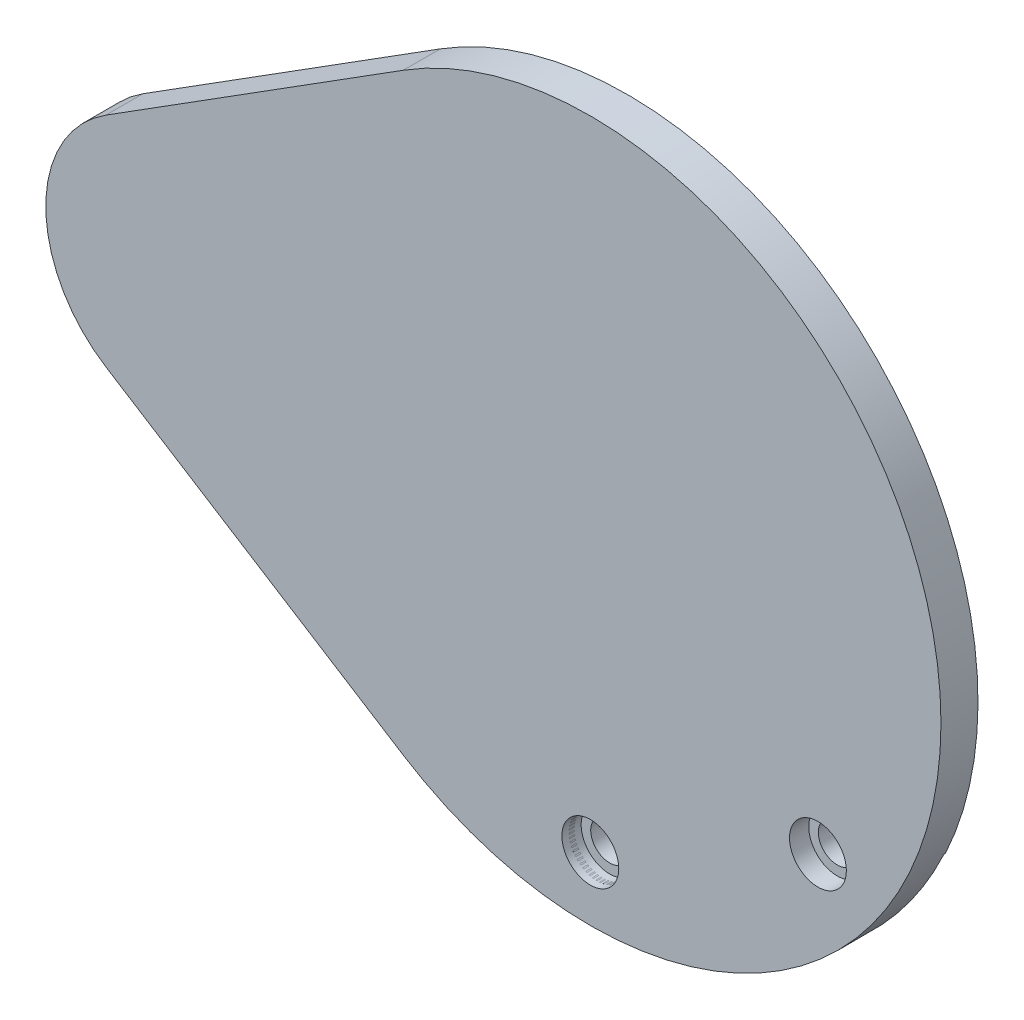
ISO-10303-21;
HEADER;
FILE_DESCRIPTION(('STEP AP214'),'2;1');
FILE_NAME('part.step','',(''),(''),'','','');
FILE_SCHEMA(('AUTOMOTIVE_DESIGN { 1 0 10303 214 1 1 1 1 }'));
ENDSEC;
DATA;
#1=APPLICATION_CONTEXT('core data for automotive mechanical design processes');
#2=APPLICATION_PROTOCOL_DEFINITION('international standard','automotive_design',2000,#1);
#3=PRODUCT_CONTEXT('',#1,'mechanical');
#4=PRODUCT('Part','Part','',(#3));
#5=PRODUCT_RELATED_PRODUCT_CATEGORY('part','',(#4));
#6=PRODUCT_DEFINITION_FORMATION('','',#4);
#7=PRODUCT_DEFINITION_CONTEXT('part definition',#1,'design');
#8=PRODUCT_DEFINITION('design','',#6,#7);
#9=PRODUCT_DEFINITION_SHAPE('','',#8);
#10=(LENGTH_UNIT() NAMED_UNIT(*) SI_UNIT(.MILLI.,.METRE.));
#11=(NAMED_UNIT(*) PLANE_ANGLE_UNIT() SI_UNIT($,.RADIAN.));
#12=(NAMED_UNIT(*) SI_UNIT($,.STERADIAN.) SOLID_ANGLE_UNIT());
#13=UNCERTAINTY_MEASURE_WITH_UNIT(LENGTH_MEASURE(1.E-05),#10,'distance_accuracy_value','');
#14=(GEOMETRIC_REPRESENTATION_CONTEXT(3) GLOBAL_UNCERTAINTY_ASSIGNED_CONTEXT((#13)) GLOBAL_UNIT_ASSIGNED_CONTEXT((#10,
#11,#12)) REPRESENTATION_CONTEXT('',''));
#15=CARTESIAN_POINT('',(0.,0.,0.));
#16=DIRECTION('',(0.,0.,1.));
#17=DIRECTION('',(1.,0.,0.));
#18=AXIS2_PLACEMENT_3D('',#15,#16,#17);
#19=CARTESIAN_POINT('',(153.008626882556,-117.697925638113,0.));
#20=DIRECTION('',(0.,0.,1.));
#21=DIRECTION('',(1.,0.,0.));
#22=AXIS2_PLACEMENT_3D('',#19,#20,#21);
#23=CYLINDRICAL_SURFACE('',#22,12.7);
#24=CARTESIAN_POINT('',(153.008626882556,-117.697925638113,11.938));
#25=DIRECTION('',(0.,0.,1.));
#26=DIRECTION('',(1.,0.,0.));
#27=AXIS2_PLACEMENT_3D('',#24,#25,#26);
#28=CIRCLE('',#27,12.7);
#29=CARTESIAN_POINT('',(165.708626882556,-117.697925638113,11.938));
#30=VERTEX_POINT('',#29);
#31=EDGE_CURVE('E163',#30,#30,#28,.T.);
#32=ORIENTED_EDGE('',*,*,#31,.T.);
#33=EDGE_LOOP('',(#32));
#34=FACE_BOUND('',#33,.T.);
#35=CARTESIAN_POINT('',(153.008626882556,-117.697925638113,1.016));
#36=DIRECTION('',(0.,0.,-1.));
#37=DIRECTION('',(-1.,0.,0.));
#38=AXIS2_PLACEMENT_3D('',#35,#36,#37);
#39=CIRCLE('',#38,12.7);
#40=CARTESIAN_POINT('',(140.308626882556,-117.697925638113,1.016));
#41=VERTEX_POINT('',#40);
#42=EDGE_CURVE('E46',#41,#41,#39,.F.);
#43=ORIENTED_EDGE('',*,*,#42,.F.);
#44=EDGE_LOOP('',(#43));
#45=FACE_BOUND('',#44,.T.);
#46=ADVANCED_FACE('F42',(#34,#45),#23,.F.);
#47=CARTESIAN_POINT('',(0.,-193.04,0.));
#48=DIRECTION('',(0.,0.,1.));
#49=DIRECTION('',(1.,0.,0.));
#50=AXIS2_PLACEMENT_3D('',#47,#48,#49);
#51=CYLINDRICAL_SURFACE('',#50,12.7);
#52=CARTESIAN_POINT('',(0.,-193.04,11.938));
#53=DIRECTION('',(0.,0.,1.));
#54=DIRECTION('',(1.,0.,0.));
#55=AXIS2_PLACEMENT_3D('',#52,#53,#54);
#56=CIRCLE('',#55,12.7);
#57=CARTESIAN_POINT('',(12.7,-193.04,11.938));
#58=VERTEX_POINT('',#57);
#59=EDGE_CURVE('E159',#58,#58,#56,.T.);
#60=ORIENTED_EDGE('',*,*,#59,.T.);
#61=EDGE_LOOP('',(#60));
#62=FACE_BOUND('',#61,.T.);
#63=CARTESIAN_POINT('',(0.,-193.04,1.016));
#64=DIRECTION('',(0.,0.,-1.));
#65=DIRECTION('',(-1.,0.,0.));
#66=AXIS2_PLACEMENT_3D('',#63,#64,#65);
#67=CIRCLE('',#66,12.7);
#68=CARTESIAN_POINT('',(-12.7,-193.04,1.016));
#69=VERTEX_POINT('',#68);
#70=EDGE_CURVE('E165',#69,#69,#67,.F.);
#71=ORIENTED_EDGE('',*,*,#70,.F.);
#72=EDGE_LOOP('',(#71));
#73=FACE_BOUND('',#72,.T.);
#74=ADVANCED_FACE('F222',(#62,#73),#51,.F.);
#75=CARTESIAN_POINT('',(-279.4,0.,24.892));
#76=DIRECTION('',(0.,0.,-1.));
#77=DIRECTION('',(-1.,0.,0.));
#78=AXIS2_PLACEMENT_3D('',#75,#76,#77);
#79=CYLINDRICAL_SURFACE('',#78,86.6983406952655);
#80=DIRECTION('',(0.,0.,-1.));
#81=VECTOR('',#80,1.);
#82=CARTESIAN_POINT('',(-325.647097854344,-73.3335408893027,24.892));
#83=LINE('',#82,#81);
#84=CARTESIAN_POINT('',(-325.647097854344,-73.3335408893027,24.892));
#85=VERTEX_POINT('',#84);
#86=CARTESIAN_POINT('',(-325.647097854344,-73.3335408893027,0.));
#87=VERTEX_POINT('',#86);
#88=EDGE_CURVE('E13',#85,#87,#83,.T.);
#89=ORIENTED_EDGE('',*,*,#88,.F.);
#90=CARTESIAN_POINT('',(-279.4,0.,24.892));
#91=DIRECTION('',(0.,0.,1.));
#92=DIRECTION('',(1.,0.,0.));
#93=AXIS2_PLACEMENT_3D('',#90,#91,#92);
#94=CIRCLE('',#93,86.6983406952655);
#95=CARTESIAN_POINT('',(-325.647097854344,73.3335408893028,24.892));
#96=VERTEX_POINT('',#95);
#97=EDGE_CURVE('E141',#96,#85,#94,.T.);
#98=ORIENTED_EDGE('',*,*,#97,.F.);
#99=DIRECTION('',(0.,0.,-1.));
#100=VECTOR('',#99,1.);
#101=CARTESIAN_POINT('',(-325.647097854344,73.3335408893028,24.892));
#102=LINE('',#101,#100);
#103=CARTESIAN_POINT('',(-325.647097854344,73.3335408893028,0.));
#104=VERTEX_POINT('',#103);
#105=EDGE_CURVE('E154',#96,#104,#102,.T.);
#106=ORIENTED_EDGE('',*,*,#105,.T.);
#107=CARTESIAN_POINT('',(-279.4,0.,0.));
#108=DIRECTION('',(0.,0.,1.));
#109=DIRECTION('',(1.,0.,0.));
#110=AXIS2_PLACEMENT_3D('',#107,#108,#109);
#111=CIRCLE('',#110,86.6983406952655);
#112=EDGE_CURVE('E136',#104,#87,#111,.T.);
#113=ORIENTED_EDGE('',*,*,#112,.T.);
#114=EDGE_LOOP('',(#89,#98,#106,#113));
#115=FACE_BOUND('',#114,.T.);
#116=ADVANCED_FACE('F198',(#115),#79,.T.);
#117=CARTESIAN_POINT('',(-325.647097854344,-73.3335408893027,24.892));
#118=DIRECTION('',(0.533425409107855,0.845847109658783,0.));
#119=DIRECTION('',(-0.845847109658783,0.533425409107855,0.));
#120=AXIS2_PLACEMENT_3D('',#117,#118,#119);
#121=PLANE('',#120);
#122=DIRECTION('',(0.,0.,-1.));
#123=VECTOR('',#122,1.);
#124=CARTESIAN_POINT('',(-125.748319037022,-199.397798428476,24.892));
#125=LINE('',#124,#123);
#126=CARTESIAN_POINT('',(-125.748319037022,-199.397798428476,24.892));
#127=VERTEX_POINT('',#126);
#128=CARTESIAN_POINT('',(-125.748319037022,-199.397798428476,0.));
#129=VERTEX_POINT('',#128);
#130=EDGE_CURVE('E51',#127,#129,#125,.T.);
#131=ORIENTED_EDGE('',*,*,#130,.F.);
#132=DIRECTION('',(0.845847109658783,-0.533425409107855,0.));
#133=VECTOR('',#132,1.);
#134=CARTESIAN_POINT('',(-325.647097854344,-73.3335408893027,24.892));
#135=LINE('',#134,#133);
#136=EDGE_CURVE('E143',#85,#127,#135,.T.);
#137=ORIENTED_EDGE('',*,*,#136,.F.);
#138=ORIENTED_EDGE('',*,*,#88,.T.);
#139=DIRECTION('',(0.845847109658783,-0.533425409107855,0.));
#140=VECTOR('',#139,1.);
#141=CARTESIAN_POINT('',(-325.647097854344,-73.3335408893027,0.));
#142=LINE('',#141,#140);
#143=EDGE_CURVE('E132',#87,#129,#142,.T.);
#144=ORIENTED_EDGE('',*,*,#143,.T.);
#145=EDGE_LOOP('',(#131,#137,#138,#144));
#146=FACE_BOUND('',#145,.T.);
#147=ADVANCED_FACE('F44',(#146),#121,.F.);
#148=CARTESIAN_POINT('',(0.,0.,24.892));
#149=DIRECTION('',(0.,0.,-1.));
#150=DIRECTION('',(-1.,0.,0.));
#151=AXIS2_PLACEMENT_3D('',#148,#149,#150);
#152=CYLINDRICAL_SURFACE('',#151,235.7374);
#153=CARTESIAN_POINT('',(0.,0.,0.));
#154=DIRECTION('',(0.,0.,1.));
#155=DIRECTION('',(1.,0.,0.));
#156=AXIS2_PLACEMENT_3D('',#153,#154,#155);
#157=CIRCLE('',#156,235.7374);
#158=CARTESIAN_POINT('',(51.6243738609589,-230.015316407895,0.));
#159=VERTEX_POINT('',#158);
#160=CARTESIAN_POINT('',(150.840478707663,-181.160900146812,0.));
#161=VERTEX_POINT('',#160);
#162=EDGE_CURVE('E131',#159,#161,#157,.T.);
#163=ORIENTED_EDGE('',*,*,#162,.T.);
#164=DIRECTION('',(0.,0.,-1.));
#165=VECTOR('',#164,1.);
#166=CARTESIAN_POINT('',(150.840478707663,-181.160900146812,0.508000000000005));
#167=LINE('',#166,#165);
#168=CARTESIAN_POINT('',(150.840478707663,-181.160900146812,1.016));
#169=VERTEX_POINT('',#168);
#170=EDGE_CURVE('E59',#161,#169,#167,.F.);
#171=ORIENTED_EDGE('',*,*,#170,.T.);
#172=CARTESIAN_POINT('',(0.,0.,1.016));
#173=DIRECTION('',(0.,0.,-1.));
#174=DIRECTION('',(-1.,0.,0.));
#175=AXIS2_PLACEMENT_3D('',#172,#173,#174);
#176=CIRCLE('',#175,235.7374);
#177=CARTESIAN_POINT('',(213.792009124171,-99.3232026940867,1.016));
#178=VERTEX_POINT('',#177);
#179=EDGE_CURVE('E124',#178,#169,#176,.T.);
#180=ORIENTED_EDGE('',*,*,#179,.F.);
#181=DIRECTION('',(0.,0.,-1.));
#182=VECTOR('',#181,1.);
#183=CARTESIAN_POINT('',(213.792009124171,-99.3232026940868,0.508000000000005));
#184=LINE('',#183,#182);
#185=CARTESIAN_POINT('',(213.792009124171,-99.3232026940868,0.));
#186=VERTEX_POINT('',#185);
#187=EDGE_CURVE('E110',#178,#186,#184,.T.);
#188=ORIENTED_EDGE('',*,*,#187,.T.);
#189=CARTESIAN_POINT('',(-125.748319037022,199.397798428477,0.));
#190=VERTEX_POINT('',#189);
#191=EDGE_CURVE('E122',#186,#190,#157,.T.);
#192=ORIENTED_EDGE('',*,*,#191,.T.);
#193=DIRECTION('',(0.,0.,-1.));
#194=VECTOR('',#193,1.);
#195=CARTESIAN_POINT('',(-125.748319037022,199.397798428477,24.892));
#196=LINE('',#195,#194);
#197=CARTESIAN_POINT('',(-125.748319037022,199.397798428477,24.892));
#198=VERTEX_POINT('',#197);
#199=EDGE_CURVE('E156',#198,#190,#196,.T.);
#200=ORIENTED_EDGE('',*,*,#199,.F.);
#201=CARTESIAN_POINT('',(0.,0.,24.892));
#202=DIRECTION('',(0.,0.,1.));
#203=DIRECTION('',(1.,0.,0.));
#204=AXIS2_PLACEMENT_3D('',#201,#202,#203);
#205=CIRCLE('',#204,235.7374);
#206=EDGE_CURVE('E148',#127,#198,#205,.T.);
#207=ORIENTED_EDGE('',*,*,#206,.F.);
#208=ORIENTED_EDGE('',*,*,#130,.T.);
#209=CARTESIAN_POINT('',(-51.6243738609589,-230.015316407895,0.));
#210=VERTEX_POINT('',#209);
#211=EDGE_CURVE('E134',#129,#210,#157,.T.);
#212=ORIENTED_EDGE('',*,*,#211,.T.);
#213=DIRECTION('',(0.,0.,-1.));
#214=VECTOR('',#213,1.);
#215=CARTESIAN_POINT('',(-51.6243738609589,-230.015316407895,0.508000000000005));
#216=LINE('',#215,#214);
#217=CARTESIAN_POINT('',(-51.624373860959,-230.015316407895,1.016));
#218=VERTEX_POINT('',#217);
#219=EDGE_CURVE('E67',#210,#218,#216,.F.);
#220=ORIENTED_EDGE('',*,*,#219,.T.);
#221=CARTESIAN_POINT('',(0.,0.,1.016));
#222=DIRECTION('',(0.,0.,-1.));
#223=DIRECTION('',(-1.,0.,0.));
#224=AXIS2_PLACEMENT_3D('',#221,#222,#223);
#225=CIRCLE('',#224,235.7374);
#226=CARTESIAN_POINT('',(51.624373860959,-230.015316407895,1.016));
#227=VERTEX_POINT('',#226);
#228=EDGE_CURVE('E167',#227,#218,#225,.T.);
#229=ORIENTED_EDGE('',*,*,#228,.F.);
#230=DIRECTION('',(0.,0.,-1.));
#231=VECTOR('',#230,1.);
#232=CARTESIAN_POINT('',(51.6243738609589,-230.015316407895,0.508000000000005));
#233=LINE('',#232,#231);
#234=EDGE_CURVE('E171',#227,#159,#233,.T.);
#235=ORIENTED_EDGE('',*,*,#234,.T.);
#236=EDGE_LOOP('',(#163,#171,#180,#188,#192,#200,#207,#208,#212,#220,#229,#235));
#237=FACE_BOUND('',#236,.T.);
#238=ADVANCED_FACE('F121',(#237),#152,.T.);
#239=CARTESIAN_POINT('',(-325.647097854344,73.3335408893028,24.892));
#240=DIRECTION('',(-0.533425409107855,0.845847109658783,0.));
#241=DIRECTION('',(-0.845847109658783,-0.533425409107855,0.));
#242=AXIS2_PLACEMENT_3D('',#239,#240,#241);
#243=PLANE('',#242);
#244=DIRECTION('',(0.845847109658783,0.533425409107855,0.));
#245=VECTOR('',#244,1.);
#246=CARTESIAN_POINT('',(-325.647097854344,73.3335408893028,24.892));
#247=LINE('',#246,#245);
#248=EDGE_CURVE('E151',#96,#198,#247,.T.);
#249=ORIENTED_EDGE('',*,*,#248,.T.);
#250=ORIENTED_EDGE('',*,*,#199,.T.);
#251=DIRECTION('',(0.845847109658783,0.533425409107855,0.));
#252=VECTOR('',#251,1.);
#253=CARTESIAN_POINT('',(-325.647097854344,73.3335408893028,0.));
#254=LINE('',#253,#252);
#255=EDGE_CURVE('E130',#104,#190,#254,.T.);
#256=ORIENTED_EDGE('',*,*,#255,.F.);
#257=ORIENTED_EDGE('',*,*,#105,.F.);
#258=EDGE_LOOP('',(#249,#250,#256,#257));
#259=FACE_BOUND('',#258,.T.);
#260=ADVANCED_FACE('F207',(#259),#243,.T.);
#261=CARTESIAN_POINT('',(-279.4,0.,24.892));
#262=DIRECTION('',(0.,0.,1.));
#263=DIRECTION('',(1.,0.,0.));
#264=AXIS2_PLACEMENT_3D('',#261,#262,#263);
#265=PLANE('',#264);
#266=CARTESIAN_POINT('',(0.,-193.04,24.892));
#267=DIRECTION('',(0.,0.,1.));
#268=DIRECTION('',(1.,0.,0.));
#269=AXIS2_PLACEMENT_3D('',#266,#267,#268);
#270=CIRCLE('',#269,19.1135);
#271=CARTESIAN_POINT('',(19.1135,-193.04,24.892));
#272=VERTEX_POINT('',#271);
#273=EDGE_CURVE('E162',#272,#272,#270,.T.);
#274=ORIENTED_EDGE('',*,*,#273,.F.);
#275=EDGE_LOOP('',(#274));
#276=FACE_BOUND('',#275,.T.);
#277=CARTESIAN_POINT('',(153.008626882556,-117.697925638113,24.892));
#278=DIRECTION('',(0.,0.,1.));
#279=DIRECTION('',(1.,0.,0.));
#280=AXIS2_PLACEMENT_3D('',#277,#278,#279);
#281=CIRCLE('',#280,19.1135);
#282=CARTESIAN_POINT('',(172.122126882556,-117.697925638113,24.892));
#283=VERTEX_POINT('',#282);
#284=EDGE_CURVE('E189',#283,#283,#281,.T.);
#285=ORIENTED_EDGE('',*,*,#284,.F.);
#286=EDGE_LOOP('',(#285));
#287=FACE_BOUND('',#286,.T.);
#288=ORIENTED_EDGE('',*,*,#97,.T.);
#289=ORIENTED_EDGE('',*,*,#136,.T.);
#290=ORIENTED_EDGE('',*,*,#206,.T.);
#291=ORIENTED_EDGE('',*,*,#248,.F.);
#292=EDGE_LOOP('',(#288,#289,#290,#291));
#293=FACE_BOUND('',#292,.T.);
#294=ADVANCED_FACE('F204',(#276,#287,#293),#265,.T.);
#295=CARTESIAN_POINT('',(-279.4,0.,0.));
#296=DIRECTION('',(0.,0.,1.));
#297=DIRECTION('',(1.,0.,0.));
#298=AXIS2_PLACEMENT_3D('',#295,#296,#297);
#299=PLANE('',#298);
#300=ORIENTED_EDGE('',*,*,#191,.F.);
#301=CARTESIAN_POINT('',(153.008626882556,-117.697925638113,0.));
#302=DIRECTION('',(0.,0.,-1.));
#303=DIRECTION('',(-1.,0.,0.));
#304=AXIS2_PLACEMENT_3D('',#301,#302,#303);
#305=CIRCLE('',#304,63.5);
#306=EDGE_CURVE('E107',#161,#186,#305,.T.);
#307=ORIENTED_EDGE('',*,*,#306,.F.);
#308=ORIENTED_EDGE('',*,*,#162,.F.);
#309=CARTESIAN_POINT('',(0.,-193.04,0.));
#310=DIRECTION('',(0.,0.,-1.));
#311=DIRECTION('',(-1.,0.,0.));
#312=AXIS2_PLACEMENT_3D('',#309,#310,#311);
#313=CIRCLE('',#312,63.5);
#314=EDGE_CURVE('E174',#210,#159,#313,.T.);
#315=ORIENTED_EDGE('',*,*,#314,.F.);
#316=ORIENTED_EDGE('',*,*,#211,.F.);
#317=ORIENTED_EDGE('',*,*,#143,.F.);
#318=ORIENTED_EDGE('',*,*,#112,.F.);
#319=ORIENTED_EDGE('',*,*,#255,.T.);
#320=EDGE_LOOP('',(#300,#307,#308,#315,#316,#317,#318,#319));
#321=FACE_BOUND('',#320,.T.);
#322=ADVANCED_FACE('F127',(#321),#299,.F.);
#323=CARTESIAN_POINT('',(153.008626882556,-117.697925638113,11.938));
#324=DIRECTION('',(0.,0.,1.));
#325=DIRECTION('',(1.,0.,0.));
#326=AXIS2_PLACEMENT_3D('',#323,#324,#325);
#327=CYLINDRICAL_SURFACE('',#326,19.1135);
#328=CARTESIAN_POINT('',(153.008626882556,-117.697925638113,11.938));
#329=DIRECTION('',(0.,0.,1.));
#330=DIRECTION('',(1.,0.,0.));
#331=AXIS2_PLACEMENT_3D('',#328,#329,#330);
#332=CIRCLE('',#331,19.1135);
#333=CARTESIAN_POINT('',(172.122126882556,-117.697925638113,11.938));
#334=VERTEX_POINT('',#333);
#335=EDGE_CURVE('E192',#334,#334,#332,.T.);
#336=ORIENTED_EDGE('',*,*,#335,.F.);
#337=EDGE_LOOP('',(#336));
#338=FACE_BOUND('',#337,.T.);
#339=ORIENTED_EDGE('',*,*,#284,.T.);
#340=EDGE_LOOP('',(#339));
#341=FACE_BOUND('',#340,.T.);
#342=ADVANCED_FACE('F218',(#338,#341),#327,.F.);
#343=CARTESIAN_POINT('',(153.008626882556,-117.697925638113,11.938));
#344=DIRECTION('',(0.,0.,1.));
#345=DIRECTION('',(1.,0.,0.));
#346=AXIS2_PLACEMENT_3D('',#343,#344,#345);
#347=PLANE('',#346);
#348=ORIENTED_EDGE('',*,*,#31,.F.);
#349=EDGE_LOOP('',(#348));
#350=FACE_BOUND('',#349,.T.);
#351=ORIENTED_EDGE('',*,*,#335,.T.);
#352=EDGE_LOOP('',(#351));
#353=FACE_BOUND('',#352,.T.);
#354=ADVANCED_FACE('F220',(#350,#353),#347,.T.);
#355=CARTESIAN_POINT('',(0.,-193.04,11.938));
#356=DIRECTION('',(0.,0.,1.));
#357=DIRECTION('',(1.,0.,0.));
#358=AXIS2_PLACEMENT_3D('',#355,#356,#357);
#359=CYLINDRICAL_SURFACE('',#358,19.1135);
#360=CARTESIAN_POINT('',(0.,-193.04,11.938));
#361=DIRECTION('',(0.,0.,1.));
#362=DIRECTION('',(1.,0.,0.));
#363=AXIS2_PLACEMENT_3D('',#360,#361,#362);
#364=CIRCLE('',#363,19.1135);
#365=CARTESIAN_POINT('',(19.1135,-193.04,11.938));
#366=VERTEX_POINT('',#365);
#367=EDGE_CURVE('E186',#366,#366,#364,.T.);
#368=ORIENTED_EDGE('',*,*,#367,.F.);
#369=EDGE_LOOP('',(#368));
#370=FACE_BOUND('',#369,.T.);
#371=ORIENTED_EDGE('',*,*,#273,.T.);
#372=EDGE_LOOP('',(#371));
#373=FACE_BOUND('',#372,.T.);
#374=ADVANCED_FACE('F238',(#370,#373),#359,.F.);
#375=CARTESIAN_POINT('',(0.,-193.04,11.938));
#376=DIRECTION('',(0.,0.,1.));
#377=DIRECTION('',(1.,0.,0.));
#378=AXIS2_PLACEMENT_3D('',#375,#376,#377);
#379=PLANE('',#378);
#380=ORIENTED_EDGE('',*,*,#59,.F.);
#381=EDGE_LOOP('',(#380));
#382=FACE_BOUND('',#381,.T.);
#383=ORIENTED_EDGE('',*,*,#367,.T.);
#384=EDGE_LOOP('',(#383));
#385=FACE_BOUND('',#384,.T.);
#386=ADVANCED_FACE('F235',(#382,#385),#379,.T.);
#387=CARTESIAN_POINT('',(0.,-193.04,1.016));
#388=DIRECTION('',(0.,0.,-1.));
#389=DIRECTION('',(-1.,0.,0.));
#390=AXIS2_PLACEMENT_3D('',#387,#388,#389);
#391=CYLINDRICAL_SURFACE('',#390,63.5);
#392=ORIENTED_EDGE('',*,*,#314,.T.);
#393=ORIENTED_EDGE('',*,*,#234,.F.);
#394=CARTESIAN_POINT('',(0.,-193.04,1.016));
#395=DIRECTION('',(0.,0.,-1.));
#396=DIRECTION('',(-1.,0.,0.));
#397=AXIS2_PLACEMENT_3D('',#394,#395,#396);
#398=CIRCLE('',#397,63.5);
#399=EDGE_CURVE('E168',#218,#227,#398,.T.);
#400=ORIENTED_EDGE('',*,*,#399,.F.);
#401=ORIENTED_EDGE('',*,*,#219,.F.);
#402=EDGE_LOOP('',(#392,#393,#400,#401));
#403=FACE_BOUND('',#402,.T.);
#404=ADVANCED_FACE('F232',(#403),#391,.F.);
#405=CARTESIAN_POINT('',(0.,-193.04,1.016));
#406=DIRECTION('',(0.,0.,-1.));
#407=DIRECTION('',(-1.,0.,0.));
#408=AXIS2_PLACEMENT_3D('',#405,#406,#407);
#409=PLANE('',#408);
#410=ORIENTED_EDGE('',*,*,#70,.T.);
#411=EDGE_LOOP('',(#410));
#412=FACE_BOUND('',#411,.T.);
#413=ORIENTED_EDGE('',*,*,#228,.T.);
#414=ORIENTED_EDGE('',*,*,#399,.T.);
#415=EDGE_LOOP('',(#413,#414));
#416=FACE_BOUND('',#415,.T.);
#417=ADVANCED_FACE('F297',(#412,#416),#409,.T.);
#418=CARTESIAN_POINT('',(153.008626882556,-117.697925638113,1.016));
#419=DIRECTION('',(0.,0.,-1.));
#420=DIRECTION('',(-1.,0.,0.));
#421=AXIS2_PLACEMENT_3D('',#418,#419,#420);
#422=CYLINDRICAL_SURFACE('',#421,63.5);
#423=ORIENTED_EDGE('',*,*,#306,.T.);
#424=ORIENTED_EDGE('',*,*,#187,.F.);
#425=CARTESIAN_POINT('',(153.008626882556,-117.697925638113,1.016));
#426=DIRECTION('',(0.,0.,-1.));
#427=DIRECTION('',(-1.,0.,0.));
#428=AXIS2_PLACEMENT_3D('',#425,#426,#427);
#429=CIRCLE('',#428,63.5);
#430=EDGE_CURVE('E116',#169,#178,#429,.T.);
#431=ORIENTED_EDGE('',*,*,#430,.F.);
#432=ORIENTED_EDGE('',*,*,#170,.F.);
#433=EDGE_LOOP('',(#423,#424,#431,#432));
#434=FACE_BOUND('',#433,.T.);
#435=ADVANCED_FACE('F109',(#434),#422,.F.);
#436=CARTESIAN_POINT('',(153.008626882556,-117.697925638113,1.016));
#437=DIRECTION('',(0.,0.,-1.));
#438=DIRECTION('',(-1.,0.,0.));
#439=AXIS2_PLACEMENT_3D('',#436,#437,#438);
#440=PLANE('',#439);
#441=ORIENTED_EDGE('',*,*,#42,.T.);
#442=EDGE_LOOP('',(#441));
#443=FACE_BOUND('',#442,.T.);
#444=ORIENTED_EDGE('',*,*,#179,.T.);
#445=ORIENTED_EDGE('',*,*,#430,.T.);
#446=EDGE_LOOP('',(#444,#445));
#447=FACE_BOUND('',#446,.T.);
#448=ADVANCED_FACE('F308',(#443,#447),#440,.T.);
#449=CLOSED_SHELL('',(#46,#74,#116,#147,#238,#260,#294,#322,#342,#354,#374,#386,#404,#417,#435,#448));
#450=CARTESIAN_POINT('',(21.209,-193.675,16.637));
#451=DIRECTION('',(0.,0.,1.));
#452=DIRECTION('',(1.,0.,0.));
#453=AXIS2_PLACEMENT_3D('',#450,#451,#452);
#454=PLANE('',#453);
#455=CARTESIAN_POINT('',(0.,-193.04,16.637));
#456=DIRECTION('',(0.,0.,-1.));
#457=DIRECTION('',(-1.,0.,0.));
#458=AXIS2_PLACEMENT_3D('',#455,#456,#457);
#459=CIRCLE('',#458,19.1240452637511);
#460=CARTESIAN_POINT('',(-19.1240452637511,-193.04,16.637));
#461=VERTEX_POINT('',#460);
#462=EDGE_CURVE('E357',#461,#461,#459,.T.);
#463=ORIENTED_EDGE('',*,*,#462,.T.);
#464=EDGE_LOOP('',(#463));
#465=FACE_BOUND('',#464,.T.);
#466=CARTESIAN_POINT('',(0.,-193.04,16.637));
#467=DIRECTION('',(0.,0.,-1.));
#468=DIRECTION('',(-1.,0.,0.));
#469=AXIS2_PLACEMENT_3D('',#466,#467,#468);
#470=CIRCLE('',#469,21.2185038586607);
#471=CARTESIAN_POINT('',(-21.2185038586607,-193.04,16.637));
#472=VERTEX_POINT('',#471);
#473=EDGE_CURVE('E117',#472,#472,#470,.T.);
#474=ORIENTED_EDGE('',*,*,#473,.F.);
#475=EDGE_LOOP('',(#474));
#476=FACE_BOUND('',#475,.T.);
#477=ADVANCED_FACE('F319',(#465,#476),#454,.T.);
#478=CARTESIAN_POINT('',(0.,-193.04,18.415));
#479=DIRECTION('',(0.,0.,-1.));
#480=DIRECTION('',(-1.,0.,0.));
#481=AXIS2_PLACEMENT_3D('',#478,#479,#480);
#482=CYLINDRICAL_SURFACE('',#481,21.2185038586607);
#483=ORIENTED_EDGE('',*,*,#473,.T.);
#484=EDGE_LOOP('',(#483));
#485=FACE_BOUND('',#484,.T.);
#486=CARTESIAN_POINT('',(0.,-193.04,20.193));
#487=DIRECTION('',(0.,0.,-1.));
#488=DIRECTION('',(-1.,0.,0.));
#489=AXIS2_PLACEMENT_3D('',#486,#487,#488);
#490=CIRCLE('',#489,21.2185038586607);
#491=CARTESIAN_POINT('',(-21.2185038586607,-193.04,20.193));
#492=VERTEX_POINT('',#491);
#493=EDGE_CURVE('E359',#492,#492,#490,.T.);
#494=ORIENTED_EDGE('',*,*,#493,.F.);
#495=EDGE_LOOP('',(#494));
#496=FACE_BOUND('',#495,.T.);
#497=ADVANCED_FACE('F323',(#485,#496),#482,.F.);
#498=CARTESIAN_POINT('',(19.1135,-193.675,20.193));
#499=DIRECTION('',(0.,0.,-1.));
#500=DIRECTION('',(-1.,0.,0.));
#501=AXIS2_PLACEMENT_3D('',#498,#499,#500);
#502=PLANE('',#501);
#503=ORIENTED_EDGE('',*,*,#493,.T.);
#504=EDGE_LOOP('',(#503));
#505=FACE_BOUND('',#504,.T.);
#506=CARTESIAN_POINT('',(0.,-193.04,20.193));
#507=DIRECTION('',(0.,0.,-1.));
#508=DIRECTION('',(-1.,0.,0.));
#509=AXIS2_PLACEMENT_3D('',#506,#507,#508);
#510=CIRCLE('',#509,19.1240452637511);
#511=CARTESIAN_POINT('',(-19.1240452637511,-193.04,20.193));
#512=VERTEX_POINT('',#511);
#513=EDGE_CURVE('E354',#512,#512,#510,.T.);
#514=ORIENTED_EDGE('',*,*,#513,.F.);
#515=EDGE_LOOP('',(#514));
#516=FACE_BOUND('',#515,.T.);
#517=ADVANCED_FACE('F332',(#505,#516),#502,.T.);
#518=CARTESIAN_POINT('',(0.,-193.04,18.415));
#519=DIRECTION('',(0.,0.,-1.));
#520=DIRECTION('',(-1.,0.,0.));
#521=AXIS2_PLACEMENT_3D('',#518,#519,#520);
#522=CYLINDRICAL_SURFACE('',#521,19.1240452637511);
#523=ORIENTED_EDGE('',*,*,#513,.T.);
#524=EDGE_LOOP('',(#523));
#525=FACE_BOUND('',#524,.T.);
#526=ORIENTED_EDGE('',*,*,#462,.F.);
#527=EDGE_LOOP('',(#526));
#528=FACE_BOUND('',#527,.T.);
#529=ADVANCED_FACE('F340',(#525,#528),#522,.T.);
#530=CLOSED_SHELL('',(#477,#497,#517,#529));
#531=ORIENTED_CLOSED_SHELL('',*,#530,.T.);
#532=BREP_WITH_VOIDS('B2',#449,(#531));
#533=ADVANCED_BREP_SHAPE_REPRESENTATION('',(#18,#532),#14);
#534=SHAPE_DEFINITION_REPRESENTATION(#9,#533);
ENDSEC;
END-ISO-10303-21;
